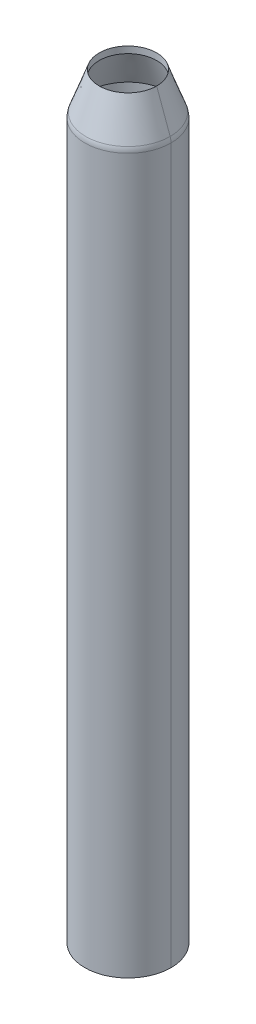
from build123d import *

# Parameters (mm, degrees)
EVIDEMENT_TRAPPE_REACH      = 1005.244
EVIDEMENT_TRAPPE_END_RADIUS = 57
CONG_1_R                    = 20


with BuildPart() as part:
    # Esquisse1 → tube (revolve)
    with BuildSketch(Plane.XY, mode=Mode.PRIVATE) as tube_sk:
        Polygon((57, 0), (57, 947.79792903), (38, 1000), (38, 991.2285868), (54, 947.268948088), (54, 0), align=None)
    revolve(tube_sk.sketch.rotate(Axis((0, 3115.539934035, 0), (0, -1, 0)), 180), axis=Axis((0, 3115.539934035, 0), (0, -1, 0)))

    # evidement_trappe: up to this cylinder (the profile starts inside it)
    evidement_trappe_end = Plane(origin=(0, 690, 0), z_dir=(0, 1, 0)) * Cylinder(EVIDEMENT_TRAPPE_END_RADIUS, 2125.488, mode=Mode.PRIVATE)
    # Esquisse5 → evidement_trappe (cut, up to the surface)
    with BuildSketch(Plane.XY, mode=Mode.PRIVATE) as evidement_trappe_sk1:
        with BuildLine():
            Line((40, 850), (40, 530))
            ThreePointArc((40, 530), (0, 490), (-40, 530))
            Line((-40, 530), (-40, 850))
            ThreePointArc((-40, 850), (0, 890), (40, 850))
        make_face()
    evidement_trappe_tool1 = extrude(evidement_trappe_sk1.sketch, amount=-EVIDEMENT_TRAPPE_REACH, mode=Mode.PRIVATE) & evidement_trappe_end
    add(evidement_trappe_tool1.solids().sort_by_distance((0, 690, 0))[0], mode=Mode.SUBTRACT)

    # Cong_1
    cong_1_edges = [part.edges().sort_by_distance(p)[0] for p in [
        (57, 947.79792903, 0),
    ]]
    fillet(cong_1_edges, radius=CONG_1_R)


solid = part.part
